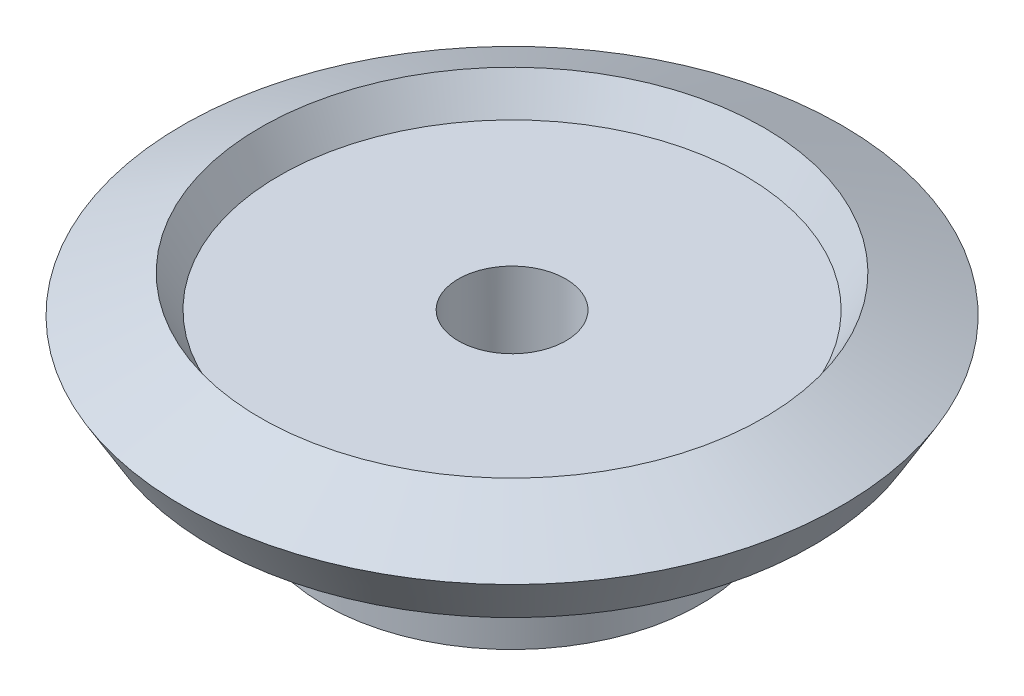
ISO-10303-21;
HEADER;
FILE_DESCRIPTION(('STEP AP214'),'2;1');
FILE_NAME('part.step','',(''),(''),'','','');
FILE_SCHEMA(('AUTOMOTIVE_DESIGN { 1 0 10303 214 1 1 1 1 }'));
ENDSEC;
DATA;
#1=APPLICATION_CONTEXT('core data for automotive mechanical design processes');
#2=APPLICATION_PROTOCOL_DEFINITION('international standard','automotive_design',2000,#1);
#3=PRODUCT_CONTEXT('',#1,'mechanical');
#4=PRODUCT('Part','Part','',(#3));
#5=PRODUCT_RELATED_PRODUCT_CATEGORY('part','',(#4));
#6=PRODUCT_DEFINITION_FORMATION('','',#4);
#7=PRODUCT_DEFINITION_CONTEXT('part definition',#1,'design');
#8=PRODUCT_DEFINITION('design','',#6,#7);
#9=PRODUCT_DEFINITION_SHAPE('','',#8);
#10=(LENGTH_UNIT() NAMED_UNIT(*) SI_UNIT(.MILLI.,.METRE.));
#11=(NAMED_UNIT(*) PLANE_ANGLE_UNIT() SI_UNIT($,.RADIAN.));
#12=(NAMED_UNIT(*) SI_UNIT($,.STERADIAN.) SOLID_ANGLE_UNIT());
#13=UNCERTAINTY_MEASURE_WITH_UNIT(LENGTH_MEASURE(1.E-05),#10,'distance_accuracy_value','');
#14=(GEOMETRIC_REPRESENTATION_CONTEXT(3) GLOBAL_UNCERTAINTY_ASSIGNED_CONTEXT((#13)) GLOBAL_UNIT_ASSIGNED_CONTEXT((#10,
#11,#12)) REPRESENTATION_CONTEXT('',''));
#15=CARTESIAN_POINT('',(0.,0.,0.));
#16=DIRECTION('',(0.,0.,1.));
#17=DIRECTION('',(1.,0.,0.));
#18=AXIS2_PLACEMENT_3D('',#15,#16,#17);
#19=CARTESIAN_POINT('',(0.,0.,0.));
#20=DIRECTION('',(0.,-1.00000000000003,0.));
#21=DIRECTION('',(0.,0.,-1.));
#22=AXIS2_PLACEMENT_3D('',#19,#20,#21);
#23=CYLINDRICAL_SURFACE('',#22,5.);
#24=CARTESIAN_POINT('',(4.91255733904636,6.00000000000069,-0.931010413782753));
#25=CARTESIAN_POINT('',(4.91255734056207,6.08992939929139,-0.931010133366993));
#26=CARTESIAN_POINT('',(4.91111901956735,6.17985768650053,-0.938698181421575));
#27=CARTESIAN_POINT('',(4.90522296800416,6.35705367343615,-0.969030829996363));
#28=CARTESIAN_POINT('',(4.9007646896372,6.44432088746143,-0.991678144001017));
#29=CARTESIAN_POINT('',(4.88844260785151,6.61359969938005,-1.05072742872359));
#30=CARTESIAN_POINT('',(4.88058536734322,6.69562107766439,-1.0871028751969));
#31=CARTESIAN_POINT('',(4.86089265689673,6.85258149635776,-1.17201330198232));
#32=CARTESIAN_POINT('',(4.84905633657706,6.92751901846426,-1.22055088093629));
#33=CARTESIAN_POINT('',(4.82025553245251,7.07105763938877,-1.32982383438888));
#34=CARTESIAN_POINT('',(4.80312692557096,7.1393474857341,-1.39092490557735));
#35=CARTESIAN_POINT('',(4.76320784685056,7.26485926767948,-1.52201845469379));
#36=CARTESIAN_POINT('',(4.74041648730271,7.32207946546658,-1.59201232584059));
#37=CARTESIAN_POINT('',(4.6879776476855,7.42523358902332,-1.74046234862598));
#38=CARTESIAN_POINT('',(4.65817007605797,7.47084230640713,-1.81908884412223));
#39=CARTESIAN_POINT('',(4.59183729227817,7.54732873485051,-1.98056425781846));
#40=CARTESIAN_POINT('',(4.55531385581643,7.57821033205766,-2.06341205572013));
#41=CARTESIAN_POINT('',(4.47725284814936,7.62331307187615,-2.22759584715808));
#42=CARTESIAN_POINT('',(4.43592913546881,7.63806721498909,-2.30888683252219));
#43=CARTESIAN_POINT('',(4.34824015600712,7.6521899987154,-2.47006387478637));
#44=CARTESIAN_POINT('',(4.30187616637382,7.65156252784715,-2.54995028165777));
#45=CARTESIAN_POINT('',(4.20741850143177,7.63528002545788,-2.70285048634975));
#46=CARTESIAN_POINT('',(4.15945987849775,7.62020373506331,-2.77601043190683));
#47=CARTESIAN_POINT('',(4.06188108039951,7.57640739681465,-2.9169284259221));
#48=CARTESIAN_POINT('',(4.01226079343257,7.54768642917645,-2.98468610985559));
#49=CARTESIAN_POINT('',(3.91257867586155,7.47707262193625,-3.11424171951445));
#50=CARTESIAN_POINT('',(3.8625194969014,7.4350133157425,-3.17595066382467));
#51=CARTESIAN_POINT('',(3.76461773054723,7.33905332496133,-3.29141183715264));
#52=CARTESIAN_POINT('',(3.71677575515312,7.28514939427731,-3.3451618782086));
#53=CARTESIAN_POINT('',(3.62323018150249,7.16410482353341,-3.44632712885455));
#54=CARTESIAN_POINT('',(3.57772749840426,7.09646769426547,-3.49333493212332));
#55=CARTESIAN_POINT('',(3.49367734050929,6.95137341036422,-3.57739583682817));
#56=CARTESIAN_POINT('',(3.45513089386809,6.87391480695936,-3.61444746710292));
#57=CARTESIAN_POINT('',(3.38673450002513,6.70996560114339,-3.67862312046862));
#58=CARTESIAN_POINT('',(3.35701119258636,6.62336561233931,-3.7056038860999));
#59=CARTESIAN_POINT('',(3.30901020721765,6.444452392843,-3.74853313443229));
#60=CARTESIAN_POINT('',(3.29072784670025,6.35214151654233,-3.76448613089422));
#61=CARTESIAN_POINT('',(3.26751373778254,6.16880983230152,-3.78465075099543));
#62=CARTESIAN_POINT('',(3.2620262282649,6.07791315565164,-3.78935139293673));
#63=CARTESIAN_POINT('',(3.26316956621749,5.89626215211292,-3.78836725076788));
#64=CARTESIAN_POINT('',(3.2697982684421,5.80550780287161,-3.78268430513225));
#65=CARTESIAN_POINT('',(3.29425527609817,5.62987992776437,-3.7613996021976));
#66=CARTESIAN_POINT('',(3.31170172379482,5.54491123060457,-3.74613582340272));
#67=CARTESIAN_POINT('',(3.3563109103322,5.37987739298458,-3.70622001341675));
#68=CARTESIAN_POINT('',(3.38347534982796,5.29981311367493,-3.68156633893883));
#69=CARTESIAN_POINT('',(3.44692776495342,5.14408997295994,-3.62224051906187));
#70=CARTESIAN_POINT('',(3.48347421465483,5.06864683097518,-3.5872794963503));
#71=CARTESIAN_POINT('',(3.56326797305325,4.92672439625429,-3.50803054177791));
#72=CARTESIAN_POINT('',(3.60651721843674,4.86024770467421,-3.4637399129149));
#73=CARTESIAN_POINT('',(3.69979967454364,4.73491681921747,-3.36397877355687));
#74=CARTESIAN_POINT('',(3.75005620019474,4.67656776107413,-3.30808063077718));
#75=CARTESIAN_POINT('',(3.85324533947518,4.57300735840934,-3.18728738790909));
#76=CARTESIAN_POINT('',(3.90617785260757,4.52779552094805,-3.1223926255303));
#77=CARTESIAN_POINT('',(4.01196744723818,4.45221100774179,-2.98522356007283));
#78=CARTESIAN_POINT('',(4.06482259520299,4.42173954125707,-2.91300242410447));
#79=CARTESIAN_POINT('',(4.16855248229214,4.37631330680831,-2.76251824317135));
#80=CARTESIAN_POINT('',(4.21942791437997,4.3613530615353,-2.68425734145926));
#81=CARTESIAN_POINT('',(4.31497479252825,4.34785918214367,-2.52765100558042));
#82=CARTESIAN_POINT('',(4.35982416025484,4.34859968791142,-2.44947597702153));
#83=CARTESIAN_POINT('',(4.44463121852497,4.36470152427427,-2.29199694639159));
#84=CARTESIAN_POINT('',(4.48458929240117,4.38006170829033,-2.21269303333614));
#85=CARTESIAN_POINT('',(4.55824674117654,4.42448830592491,-2.05662985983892));
#86=CARTESIAN_POINT('',(4.59203255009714,4.45334133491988,-1.97985022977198));
#87=CARTESIAN_POINT('',(4.65383086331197,4.5237378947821,-1.8298754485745));
#88=CARTESIAN_POINT('',(4.68184232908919,4.56528370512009,-1.75668094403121));
#89=CARTESIAN_POINT('',(4.73315022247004,4.66163265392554,-1.61347083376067));
#90=CARTESIAN_POINT('',(4.75623735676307,4.71686414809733,-1.54366861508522));
#91=CARTESIAN_POINT('',(4.79684208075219,4.83828365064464,-1.41245608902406));
#92=CARTESIAN_POINT('',(4.81435790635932,4.90447511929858,-1.35104844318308));
#93=CARTESIAN_POINT('',(4.84504742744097,5.04895585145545,-1.23659411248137));
#94=CARTESIAN_POINT('',(4.85803000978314,5.1276102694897,-1.18395569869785));
#95=CARTESIAN_POINT('',(4.87947331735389,5.29302166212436,-1.09223167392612));
#96=CARTESIAN_POINT('',(4.88793533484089,5.37977631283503,-1.05314219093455));
#97=CARTESIAN_POINT('',(4.90069084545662,5.55434327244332,-0.992047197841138));
#98=CARTESIAN_POINT('',(4.90517755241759,5.6418680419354,-0.969261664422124));
#99=CARTESIAN_POINT('',(4.91111030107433,5.81959617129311,-0.938745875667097));
#100=CARTESIAN_POINT('',(4.91255733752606,5.90979864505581,-0.93101069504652));
#101=CARTESIAN_POINT('',(4.91255733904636,6.00000000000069,-0.931010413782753));
#102=B_SPLINE_CURVE_WITH_KNOTS('',3,(#24,#25,#26,#27,#28,#29,#30,#31,#32,#33,#34,#35,#36,#37,
#38,#39,#40,#41,#42,#43,#44,#45,#46,#47,#48,#49,#50,#51,#52,#53,#54,#55,#56,#57,#58,#59,#60,#61,
#62,#63,#64,#65,#66,#67,#68,#69,#70,#71,#72,#73,#74,#75,#76,#77,#78,#79,#80,#81,#82,#83,#84,#85,
#86,#87,#88,#89,#90,#91,#92,#93,#94,#95,#96,#97,#98,#99,#100,#101),.UNSPECIFIED.,.T.,.F.,(4,2,2,
2,2,2,2,2,2,2,2,2,2,2,2,2,2,2,2,2,2,2,2,2,2,2,2,2,2,2,2,2,2,2,2,2,2,2,4),(0.,0.269454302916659,
0.538957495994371,0.807942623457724,1.07698527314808,1.35539043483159,1.63383926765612,
1.919392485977,2.20487031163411,2.48059787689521,2.75625573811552,3.0213144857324,
3.28639110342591,3.55491555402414,3.82351368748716,4.1045213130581,4.38557043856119,
4.67047751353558,4.95526790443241,5.22743703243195,5.49955797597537,5.76258081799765,
6.02564971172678,6.29693565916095,6.56830013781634,6.85241935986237,7.13652791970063,
7.41870503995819,7.70078248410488,7.96984890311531,8.23889422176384,8.50382155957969,
8.76879650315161,9.04343817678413,9.31816672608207,9.60337461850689,9.88850093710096,
10.1588585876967,10.4291277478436),.UNSPECIFIED.);
#103=CARTESIAN_POINT('',(4.91255733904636,6.00000000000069,-0.931010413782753));
#104=VERTEX_POINT('',#103);
#105=EDGE_CURVE('E115',#104,#104,#102,.T.);
#106=ORIENTED_EDGE('',*,*,#105,.F.);
#107=EDGE_LOOP('',(#106));
#108=FACE_BOUND('',#107,.T.);
#109=CARTESIAN_POINT('',(-3.26255733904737,6.00000000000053,-3.78889424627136));
#110=CARTESIAN_POINT('',(-3.26255709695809,6.08992939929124,-3.78889438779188));
#111=CARTESIAN_POINT('',(-3.26849598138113,6.17985768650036,-3.78380474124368));
#112=CARTESIAN_POINT('',(-3.29181679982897,6.35705367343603,-3.76353228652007));
#113=CARTESIAN_POINT('',(-3.30920080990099,6.44432088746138,-3.74834764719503));
#114=CARTESIAN_POINT('',(-3.35417794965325,6.61359969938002,-3.7081517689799));
#115=CARTESIAN_POINT('',(-3.38175139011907,6.6956210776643,-3.6831594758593));
#116=CARTESIAN_POINT('',(-3.44543962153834,6.85258149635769,-3.62364987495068));
#117=CARTESIAN_POINT('',(-3.48155623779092,6.92751901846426,-3.58913053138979));
#118=CARTESIAN_POINT('',(-3.56178898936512,7.07105763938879,-3.50955182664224));
#119=CARTESIAN_POINT('',(-3.60613976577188,7.13934748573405,-3.46416748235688));
#120=CARTESIAN_POINT('',(-3.69971057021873,7.26485926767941,-3.36404977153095));
#121=CARTESIAN_POINT('',(-3.74893136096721,7.32207946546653,-3.30931493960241));
#122=CARTESIAN_POINT('',(-3.85127343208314,7.42523358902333,-3.18967656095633));
#123=CARTESIAN_POINT('',(-3.90446218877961,7.47084230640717,-3.12454919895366));
#124=CARTESIAN_POINT('',(-4.01113760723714,7.54732873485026,-2.98636561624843));
#125=CARTESIAN_POINT('',(-4.06462418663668,7.57821033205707,-2.91331149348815));
#126=CARTESIAN_POINT('',(-4.16778101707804,7.62331307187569,-2.76361678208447));
#127=CARTESIAN_POINT('',(-4.2175192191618,7.63806721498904,-2.68718390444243));
#128=CARTESIAN_POINT('',(-4.31325814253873,7.65218999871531,-2.53065449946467));
#129=CARTESIAN_POINT('',(-4.3592598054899,7.65156252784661,-2.45055890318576));
#130=CARTESIAN_POINT('',(-4.44444643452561,7.63528002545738,-2.29230606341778));
#131=CARTESIAN_POINT('',(-4.48382549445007,7.62020373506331,-2.21419270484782));
#132=CARTESIAN_POINT('',(-4.55707465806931,7.57640739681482,-2.05922798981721));
#133=CARTESIAN_POINT('',(-4.59094439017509,7.54768642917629,-1.98237671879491));
#134=CARTESIAN_POINT('',(-4.65330178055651,7.47707262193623,-1.83127166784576));
#135=CARTESIAN_POINT('',(-4.68171370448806,7.43501331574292,-1.75706467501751));
#136=CARTESIAN_POINT('',(-4.73275513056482,7.33905332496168,-1.6145486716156));
#137=CARTESIAN_POINT('',(-4.7553830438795,7.28514939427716,-1.54624128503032));
#138=CARTESIAN_POINT('',(-4.79622193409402,7.16410482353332,-1.41464581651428));
#139=CARTESIAN_POINT('',(-4.81418054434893,7.09646769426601,-1.35173543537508));
#140=CARTESIAN_POINT('',(-4.84495434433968,6.95137341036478,-1.2369154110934));
#141=CARTESIAN_POINT('',(-4.85776877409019,6.87391480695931,-1.18500739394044));
#142=CARTESIAN_POINT('',(-4.87914832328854,6.70996560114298,-1.09368655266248));
#143=CARTESIAN_POINT('',(-4.88765269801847,6.62336561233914,-1.05445503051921));
#144=CARTESIAN_POINT('',(-4.9008300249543,6.444452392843,-0.991420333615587));
#145=CARTESIAN_POINT('',(-4.90550454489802,6.35214151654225,-0.967610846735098));
#146=CARTESIAN_POINT('',(-4.91136056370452,6.16880983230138,-0.937424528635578));
#147=CARTESIAN_POINT('',(-4.91268768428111,6.07791315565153,-0.930321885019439));
#148=CARTESIAN_POINT('',(-4.91240706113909,5.89626215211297,-0.931804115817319));
#149=CARTESIAN_POINT('',(-4.91079983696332,5.80550780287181,-0.9403862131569));
#150=CARTESIAN_POINT('',(-4.90459524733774,5.62987992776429,-0.972208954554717));
#151=CARTESIAN_POINT('',(-4.90009965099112,5.54491123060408,-0.994949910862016));
#152=CARTESIAN_POINT('',(-4.88783613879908,5.37987739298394,-1.05354050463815));
#153=CARTESIAN_POINT('',(-4.88006765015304,5.29981311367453,-1.08939243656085));
#154=CARTESIAN_POINT('',(-4.86041619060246,5.14408997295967,-1.17400674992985));
#155=CARTESIAN_POINT('',(-4.84841228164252,5.06864683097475,-1.22313741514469));
#156=CARTESIAN_POINT('',(-4.81967755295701,4.92672439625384,-1.33186531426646));
#157=CARTESIAN_POINT('',(-4.80294536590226,4.86024770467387,-1.39146557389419));
#158=CARTESIAN_POINT('',(-4.76319091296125,4.73491681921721,-1.52213112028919));
#159=CARTESIAN_POINT('',(-4.73990996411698,4.67656776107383,-1.59360361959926));
#160=CARTESIAN_POINT('',(-4.68689451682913,4.57300735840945,-1.74336465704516));
#161=CARTESIAN_POINT('',(-4.65716026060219,4.5277955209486,-1.82165293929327));
#162=CARTESIAN_POINT('',(-4.59126316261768,4.45221100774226,-1.981853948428));
#163=CARTESIAN_POINT('',(-4.55514539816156,4.42173954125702,-2.06373841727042));
#164=CARTESIAN_POINT('',(-4.47668721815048,4.37631330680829,-2.22881322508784));
#165=CARTESIAN_POINT('',(-4.43434900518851,4.36135306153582,-2.3120030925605));
#166=CARTESIAN_POINT('',(-4.34649737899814,4.34785918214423,-2.47305228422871));
#167=CARTESIAN_POINT('',(-4.30122050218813,4.3485996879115,-2.55098049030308));
#168=CARTESIAN_POINT('',(-4.20724319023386,4.36470152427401,-2.70316507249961));
#169=CARTESIAN_POINT('',(-4.15854302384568,4.38006170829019,-2.77742173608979));
#170=CARTESIAN_POINT('',(-4.06021707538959,4.42448830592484,-2.91924254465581));
#171=CARTESIAN_POINT('',(-4.01061686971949,4.45334133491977,-2.98689172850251));
#172=CARTESIAN_POINT('',(-3.91163405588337,4.52373789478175,-3.11539802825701));
#173=CARTESIAN_POINT('',(-3.86225148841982,4.56528370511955,-3.17625392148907));
#174=CARTESIAN_POINT('',(-3.76388184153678,4.66163265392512,-3.29229291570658));
#175=CARTESIAN_POINT('',(-3.71497491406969,4.71686414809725,-3.34718806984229));
#176=CARTESIAN_POINT('',(-3.62164389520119,4.83828365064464,-3.44795905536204));
#177=CARTESIAN_POINT('',(-3.57722122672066,4.90447511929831,-3.49383202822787));
#178=CARTESIAN_POINT('',(-3.49344562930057,5.04895585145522,-3.57763709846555));
#179=CARTESIAN_POINT('',(-3.45435071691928,5.12761026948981,-3.6151995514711));
#180=CARTESIAN_POINT('',(-3.38563703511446,5.29302166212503,-3.6796320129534));
#181=CARTESIAN_POINT('',(-3.35601555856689,5.37977631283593,-3.70650507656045));
#182=CARTESIAN_POINT('',(-3.30948349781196,5.55434327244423,-3.74809916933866));
#183=CARTESIAN_POINT('',(-3.29199400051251,5.64186804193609,-3.76337753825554));
#184=CARTESIAN_POINT('',(-3.2685329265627,5.81959617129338,-3.78377334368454));
#185=CARTESIAN_POINT('',(-3.26255758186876,5.90979864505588,-3.78889410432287));
#186=CARTESIAN_POINT('',(-3.26255733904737,6.00000000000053,-3.78889424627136));
#187=B_SPLINE_CURVE_WITH_KNOTS('',3,(#109,#110,#111,#112,#113,#114,#115,#116,#117,#118,#119,
#120,#121,#122,#123,#124,#125,#126,#127,#128,#129,#130,#131,#132,#133,#134,#135,#136,#137,#138,
#139,#140,#141,#142,#143,#144,#145,#146,#147,#148,#149,#150,#151,#152,#153,#154,#155,#156,#157,
#158,#159,#160,#161,#162,#163,#164,#165,#166,#167,#168,#169,#170,#171,#172,#173,#174,#175,#176,
#177,#178,#179,#180,#181,#182,#183,#184,#185,#186),.UNSPECIFIED.,.T.,.F.,(4,2,2,2,2,2,2,2,2,2,2,
2,2,2,2,2,2,2,2,2,2,2,2,2,2,2,2,2,2,2,2,2,2,2,2,2,2,2,4),(0.,0.269454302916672,
0.538957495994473,0.807942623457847,1.07698527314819,1.35539043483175,1.63383926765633,
1.91939248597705,2.20487031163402,2.48059787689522,2.75625573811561,3.02131448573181,
3.28639110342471,3.55491555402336,3.82351368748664,4.1045213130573,4.38557043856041,
4.67047751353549,4.9552679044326,5.22743703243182,5.49955797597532,5.76258081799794,
6.02564971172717,6.29693565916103,6.56830013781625,6.85241935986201,7.13652791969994,
7.41870503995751,7.70078248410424,7.96984890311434,8.23889422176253,8.50382155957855,
8.76879650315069,9.04343817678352,9.31816672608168,9.60337461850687,9.88850093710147,
10.1588585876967,10.4291277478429),.UNSPECIFIED.);
#188=CARTESIAN_POINT('',(-3.26255733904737,6.00000000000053,-3.78889424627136));
#189=VERTEX_POINT('',#188);
#190=EDGE_CURVE('E51',#189,#189,#187,.T.);
#191=ORIENTED_EDGE('',*,*,#190,.F.);
#192=EDGE_LOOP('',(#191));
#193=FACE_BOUND('',#192,.T.);
#194=CARTESIAN_POINT('',(-1.64999999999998,6.00000000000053,4.71990466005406));
#195=CARTESIAN_POINT('',(-1.65000024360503,6.08992939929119,4.71990452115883));
#196=CARTESIAN_POINT('',(-1.64262303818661,6.17985768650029,4.72250292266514));
#197=CARTESIAN_POINT('',(-1.61340616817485,6.35705367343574,4.73256311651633));
#198=CARTESIAN_POINT('',(-1.5915638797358,6.44432088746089,4.74002579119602));
#199=CARTESIAN_POINT('',(-1.53426465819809,6.61359969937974,4.75887919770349));
#200=CARTESIAN_POINT('',(-1.49883397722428,6.69562107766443,4.77026235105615));
#201=CARTESIAN_POINT('',(-1.41545303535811,6.85258149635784,4.79566317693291));
#202=CARTESIAN_POINT('',(-1.36750009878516,6.92751901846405,4.80968141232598));
#203=CARTESIAN_POINT('',(-1.2584665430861,7.0710576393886,4.83937566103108));
#204=CARTESIAN_POINT('',(-1.19698715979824,7.13934748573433,4.85509238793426));
#205=CARTESIAN_POINT('',(-1.0634972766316,7.26485926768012,4.88606822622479));
#206=CARTESIAN_POINT('',(-0.991485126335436,7.32207946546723,4.90132726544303));
#207=CARTESIAN_POINT('',(-0.836704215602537,7.42523358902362,4.93013890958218));
#208=CARTESIAN_POINT('',(-0.753707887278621,7.47084230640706,4.94363804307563));
#209=CARTESIAN_POINT('',(-0.580699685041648,7.54732873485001,4.96692987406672));
#210=CARTESIAN_POINT('',(-0.490689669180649,7.57821033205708,4.97672354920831));
#211=CARTESIAN_POINT('',(-0.309471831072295,7.62331307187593,4.99121262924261));
#212=CARTESIAN_POINT('',(-0.218409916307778,7.6380672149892,4.9960707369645));
#213=CARTESIAN_POINT('',(-0.0349820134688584,7.65218999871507,5.00071837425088));
#214=CARTESIAN_POINT('',(0.0573836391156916,7.65156252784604,5.00050918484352));
#215=CARTESIAN_POINT('',(0.237027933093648,7.63528002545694,4.99515654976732));
#216=CARTESIAN_POINT('',(0.324365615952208,7.62020373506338,4.99020313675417));
#217=CARTESIAN_POINT('',(0.495193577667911,7.57640739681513,4.97615641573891));
#218=CARTESIAN_POINT('',(0.578683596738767,7.54768642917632,4.96706282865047));
#219=CARTESIAN_POINT('',(0.740723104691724,7.47707262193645,4.94551338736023));
#220=CARTESIAN_POINT('',(0.819194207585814,7.43501331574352,4.9330153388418));
#221=CARTESIAN_POINT('',(0.968137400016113,7.33905332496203,4.90596050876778));
#222=CARTESIAN_POINT('',(1.03860728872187,7.28514939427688,4.89140316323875));
#223=CARTESIAN_POINT('',(1.17299175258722,7.164104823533,4.86097294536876));
#224=CARTESIAN_POINT('',(1.23645304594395,7.09646769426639,4.84507036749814));
#225=CARTESIAN_POINT('',(1.35127700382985,6.95137341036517,4.81431124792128));
#226=CARTESIAN_POINT('',(1.40263788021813,6.87391480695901,4.79945486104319));
#227=CARTESIAN_POINT('',(1.49241382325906,6.70996560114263,4.77230967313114));
#228=CARTESIAN_POINT('',(1.53064150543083,6.62336561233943,4.76005891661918));
#229=CARTESIAN_POINT('',(1.59181981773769,6.44445239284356,4.73995346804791));
#230=CARTESIAN_POINT('',(1.61477669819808,6.35214151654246,4.7320969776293));
#231=CARTESIAN_POINT('',(1.64384682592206,6.16880983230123,4.72207527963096));
#232=CARTESIAN_POINT('',(1.65066145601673,6.07791315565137,4.71967327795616));
#233=CARTESIAN_POINT('',(1.64923749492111,5.89626215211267,4.72017136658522));
#234=CARTESIAN_POINT('',(1.64100156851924,5.80550780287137,4.72307051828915));
#235=CARTESIAN_POINT('',(1.6103399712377,5.62987992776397,4.73360855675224));
#236=CARTESIAN_POINT('',(1.58839792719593,5.544911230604,4.74108573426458));
#237=CARTESIAN_POINT('',(1.53152522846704,5.37987739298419,4.75976051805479));
#238=CARTESIAN_POINT('',(1.49659230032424,5.29981311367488,4.77095877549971));
#239=CARTESIAN_POINT('',(1.41348842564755,5.14408997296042,4.79624726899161));
#240=CARTESIAN_POINT('',(1.36493806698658,5.06864683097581,4.8104169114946));
#241=CARTESIAN_POINT('',(1.25640957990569,4.92672439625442,4.839895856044));
#242=CARTESIAN_POINT('',(1.19642814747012,4.86024770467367,4.855205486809));
#243=CARTESIAN_POINT('',(1.06339123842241,4.73491681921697,4.88610989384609));
#244=CARTESIAN_POINT('',(0.989853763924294,4.6765677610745,4.90168425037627));
#245=CARTESIAN_POINT('',(0.833649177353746,4.57300735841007,4.93065204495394));
#246=CARTESIAN_POINT('',(0.750982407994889,4.52779552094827,4.94404556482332));
#247=CARTESIAN_POINT('',(0.579295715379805,4.45221100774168,4.96707750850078));
#248=CARTESIAN_POINT('',(0.490322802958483,4.42173954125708,4.97674084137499));
#249=CARTESIAN_POINT('',(0.308134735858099,4.37631330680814,4.9913314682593));
#250=CARTESIAN_POINT('',(0.214921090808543,4.3613530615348,4.99626043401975));
#251=CARTESIAN_POINT('',(0.0315225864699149,4.34785918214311,5.00070328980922));
#252=CARTESIAN_POINT('',(-0.0586036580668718,4.34859968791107,5.00045646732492));
#253=CARTESIAN_POINT('',(-0.237388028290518,4.36470152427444,4.99516201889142));
#254=CARTESIAN_POINT('',(-0.326046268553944,4.38006170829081,4.99011476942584));
#255=CARTESIAN_POINT('',(-0.49802966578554,4.42448830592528,4.97587240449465));
#256=CARTESIAN_POINT('',(-0.581415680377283,4.45334133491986,4.96674195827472));
#257=CARTESIAN_POINT('',(-0.742196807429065,4.52373789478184,4.94527347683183));
#258=CARTESIAN_POINT('',(-0.819590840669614,4.56528370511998,4.93293486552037));
#259=CARTESIAN_POINT('',(-0.96926838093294,4.66163265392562,4.90576374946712));
#260=CARTESIAN_POINT('',(-1.04126244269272,4.71686414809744,4.8908566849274));
#261=CARTESIAN_POINT('',(-1.17519818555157,4.83828365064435,4.86041514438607));
#262=CARTESIAN_POINT('',(-1.23713667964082,4.90447511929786,4.84488047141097));
#263=CARTESIAN_POINT('',(-1.35160179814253,5.04895585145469,4.81423121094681));
#264=CARTESIAN_POINT('',(-1.40367929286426,5.12761026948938,4.79915525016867));
#265=CARTESIAN_POINT('',(-1.49383628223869,5.29302166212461,4.77186368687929));
#266=CARTESIAN_POINT('',(-1.53191977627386,5.37977631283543,4.75964726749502));
#267=CARTESIAN_POINT('',(-1.59120734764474,5.55434327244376,4.74014636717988));
#268=CARTESIAN_POINT('',(-1.61318355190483,5.64186804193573,4.73263920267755));
#269=CARTESIAN_POINT('',(-1.64257737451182,5.8195961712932,4.72251921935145));
#270=CARTESIAN_POINT('',(-1.64999975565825,5.90979864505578,4.71990479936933));
#271=CARTESIAN_POINT('',(-1.64999999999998,6.00000000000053,4.71990466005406));
#272=B_SPLINE_CURVE_WITH_KNOTS('',3,(#194,#195,#196,#197,#198,#199,#200,#201,#202,#203,#204,
#205,#206,#207,#208,#209,#210,#211,#212,#213,#214,#215,#216,#217,#218,#219,#220,#221,#222,#223,
#224,#225,#226,#227,#228,#229,#230,#231,#232,#233,#234,#235,#236,#237,#238,#239,#240,#241,#242,
#243,#244,#245,#246,#247,#248,#249,#250,#251,#252,#253,#254,#255,#256,#257,#258,#259,#260,#261,
#262,#263,#264,#265,#266,#267,#268,#269,#270,#271),.UNSPECIFIED.,.T.,.F.,(4,2,2,2,2,2,2,2,2,2,2,
2,2,2,2,2,2,2,2,2,2,2,2,2,2,2,2,2,2,2,2,2,2,2,2,2,2,2,4),(0.,0.269454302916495,
0.538957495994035,0.807942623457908,1.07698527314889,1.35539043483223,1.63383926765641,
1.91939248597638,2.20487031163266,2.48059787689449,2.75625573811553,3.02131448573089,
3.28639110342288,3.55491555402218,3.82351368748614,4.10452131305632,4.38557043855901,
4.67047751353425,4.9552679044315,5.2274370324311,5.49955797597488,5.76258081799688,
6.02564971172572,6.29693565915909,6.56830013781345,6.85241935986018,7.13652791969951,
7.41870503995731,7.70078248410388,7.96984890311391,8.23889422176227,8.50382155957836,
8.76879650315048,9.04343817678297,9.31816672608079,9.60337461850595,9.88850093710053,
10.158858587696,10.4291277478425),.UNSPECIFIED.);
#273=CARTESIAN_POINT('',(-1.64999999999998,6.00000000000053,4.71990466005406));
#274=VERTEX_POINT('',#273);
#275=EDGE_CURVE('E50',#274,#274,#272,.T.);
#276=ORIENTED_EDGE('',*,*,#275,.F.);
#277=EDGE_LOOP('',(#276));
#278=FACE_BOUND('',#277,.T.);
#279=CARTESIAN_POINT('',(0.,0.,0.));
#280=DIRECTION('',(0.,-1.00000000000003,0.));
#281=DIRECTION('',(0.,0.,-1.));
#282=AXIS2_PLACEMENT_3D('',#279,#280,#281);
#283=CIRCLE('',#282,5.);
#284=CARTESIAN_POINT('',(0.,0.,-5.));
#285=VERTEX_POINT('',#284);
#286=EDGE_CURVE('E74',#285,#285,#283,.T.);
#287=ORIENTED_EDGE('',*,*,#286,.T.);
#288=EDGE_LOOP('',(#287));
#289=FACE_BOUND('',#288,.T.);
#290=CARTESIAN_POINT('',(0.,15.0000000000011,0.));
#291=DIRECTION('',(0.,-1.00000000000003,0.));
#292=DIRECTION('',(0.,0.,-1.));
#293=AXIS2_PLACEMENT_3D('',#290,#291,#292);
#294=CIRCLE('',#293,5.);
#295=CARTESIAN_POINT('',(0.,15.0000000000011,-5.00000000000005));
#296=VERTEX_POINT('',#295);
#297=EDGE_CURVE('E10',#296,#296,#294,.T.);
#298=ORIENTED_EDGE('',*,*,#297,.F.);
#299=EDGE_LOOP('',(#298));
#300=FACE_BOUND('',#299,.T.);
#301=ADVANCED_FACE('F24',(#108,#193,#278,#289,#300),#23,.F.);
#302=CARTESIAN_POINT('',(21.6580899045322,15.0000000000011,-2.97882925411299E-13));
#303=DIRECTION('',(0.,1.00000000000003,0.));
#304=DIRECTION('',(0.,0.,1.));
#305=AXIS2_PLACEMENT_3D('',#302,#303,#304);
#306=PLANE('',#305);
#307=ORIENTED_EDGE('',*,*,#297,.T.);
#308=EDGE_LOOP('',(#307));
#309=FACE_BOUND('',#308,.T.);
#310=CARTESIAN_POINT('',(0.,15.0000000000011,0.));
#311=DIRECTION('',(0.,-1.00000000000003,0.));
#312=DIRECTION('',(0.,0.,-1.));
#313=AXIS2_PLACEMENT_3D('',#310,#311,#312);
#314=CIRCLE('',#313,21.6580899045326);
#315=CARTESIAN_POINT('',(2.49796390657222E-13,15.0000000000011,-21.6580899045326));
#316=VERTEX_POINT('',#315);
#317=EDGE_CURVE('E36',#316,#316,#314,.T.);
#318=ORIENTED_EDGE('',*,*,#317,.F.);
#319=EDGE_LOOP('',(#318));
#320=FACE_BOUND('',#319,.T.);
#321=ADVANCED_FACE('F99',(#309,#320),#306,.T.);
#322=CARTESIAN_POINT('',(0.,18.0000000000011,0.));
#323=DIRECTION('',(0.,1.00000000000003,0.));
#324=DIRECTION('',(0.,0.,1.));
#325=AXIS2_PLACEMENT_3D('',#322,#323,#324);
#326=CONICAL_SURFACE('',#325,23.4176206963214,0.53044152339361);
#327=ORIENTED_EDGE('',*,*,#317,.T.);
#328=EDGE_LOOP('',(#327));
#329=FACE_BOUND('',#328,.T.);
#330=CARTESIAN_POINT('',(0.,18.0000000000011,0.));
#331=DIRECTION('',(0.,-1.00000000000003,0.));
#332=DIRECTION('',(0.,0.,-1.));
#333=AXIS2_PLACEMENT_3D('',#330,#331,#332);
#334=CIRCLE('',#333,23.4176206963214);
#335=CARTESIAN_POINT('',(2.70090167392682E-13,18.0000000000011,-23.4176206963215));
#336=VERTEX_POINT('',#335);
#337=EDGE_CURVE('E41',#336,#336,#334,.T.);
#338=ORIENTED_EDGE('',*,*,#337,.F.);
#339=EDGE_LOOP('',(#338));
#340=FACE_BOUND('',#339,.T.);
#341=ADVANCED_FACE('F97',(#329,#340),#326,.F.);
#342=CARTESIAN_POINT('',(0.,14.5523500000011,0.));
#343=DIRECTION('',(0.,-1.00000000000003,0.));
#344=DIRECTION('',(0.,0.,-1.));
#345=AXIS2_PLACEMENT_3D('',#342,#343,#344);
#346=CONICAL_SURFACE('',#345,30.67,1.12703642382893);
#347=ORIENTED_EDGE('',*,*,#337,.T.);
#348=EDGE_LOOP('',(#347));
#349=FACE_BOUND('',#348,.T.);
#350=CARTESIAN_POINT('',(0.,14.5523500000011,0.));
#351=DIRECTION('',(0.,-1.00000000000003,0.));
#352=DIRECTION('',(0.,0.,-1.));
#353=AXIS2_PLACEMENT_3D('',#350,#351,#352);
#354=CIRCLE('',#353,30.67);
#355=CARTESIAN_POINT('',(2.70469698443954E-13,14.5523500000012,-30.67));
#356=VERTEX_POINT('',#355);
#357=EDGE_CURVE('E89',#356,#356,#354,.T.);
#358=ORIENTED_EDGE('',*,*,#357,.F.);
#359=EDGE_LOOP('',(#358));
#360=FACE_BOUND('',#359,.T.);
#361=ADVANCED_FACE('F94',(#349,#360),#346,.T.);
#362=CARTESIAN_POINT('',(0.,10.0000000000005,0.));
#363=DIRECTION('',(0.,1.00000000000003,0.));
#364=DIRECTION('',(0.,0.,1.));
#365=AXIS2_PLACEMENT_3D('',#362,#363,#364);
#366=CONICAL_SURFACE('',#365,28.,0.530441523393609);
#367=ORIENTED_EDGE('',*,*,#357,.T.);
#368=EDGE_LOOP('',(#367));
#369=FACE_BOUND('',#368,.T.);
#370=CARTESIAN_POINT('',(0.,10.0000000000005,0.));
#371=DIRECTION('',(0.,-1.00000000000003,0.));
#372=DIRECTION('',(0.,0.,-1.));
#373=AXIS2_PLACEMENT_3D('',#370,#371,#372);
#374=CIRCLE('',#373,28.);
#375=CARTESIAN_POINT('',(3.22941633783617E-13,10.0000000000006,-28.));
#376=VERTEX_POINT('',#375);
#377=EDGE_CURVE('E86',#376,#376,#374,.T.);
#378=ORIENTED_EDGE('',*,*,#377,.F.);
#379=EDGE_LOOP('',(#378));
#380=FACE_BOUND('',#379,.T.);
#381=ADVANCED_FACE('F106',(#369,#380),#366,.T.);
#382=CARTESIAN_POINT('',(28.,10.0000000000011,-3.54999323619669E-13));
#383=DIRECTION('',(0.,-1.00000000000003,0.));
#384=DIRECTION('',(0.,0.,-1.));
#385=AXIS2_PLACEMENT_3D('',#382,#383,#384);
#386=PLANE('',#385);
#387=ORIENTED_EDGE('',*,*,#377,.T.);
#388=EDGE_LOOP('',(#387));
#389=FACE_BOUND('',#388,.T.);
#390=CARTESIAN_POINT('',(0.,10.0000000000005,0.));
#391=DIRECTION('',(0.,-1.00000000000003,0.));
#392=DIRECTION('',(0.,0.,-1.));
#393=AXIS2_PLACEMENT_3D('',#390,#391,#392);
#394=CIRCLE('',#393,17.5);
#395=CARTESIAN_POINT('',(2.01838521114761E-13,10.0000000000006,-17.5));
#396=VERTEX_POINT('',#395);
#397=EDGE_CURVE('E83',#396,#396,#394,.T.);
#398=ORIENTED_EDGE('',*,*,#397,.F.);
#399=EDGE_LOOP('',(#398));
#400=FACE_BOUND('',#399,.T.);
#401=ADVANCED_FACE('F129',(#389,#400),#386,.T.);
#402=CARTESIAN_POINT('',(0.,0.,0.));
#403=DIRECTION('',(0.,-1.00000000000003,0.));
#404=DIRECTION('',(0.,0.,-1.));
#405=AXIS2_PLACEMENT_3D('',#402,#403,#404);
#406=CYLINDRICAL_SURFACE('',#405,17.5);
#407=CARTESIAN_POINT('',(15.9129297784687,6.00000000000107,-7.28207840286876));
#408=CARTESIAN_POINT('',(15.9129286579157,5.90754004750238,-7.28208239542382));
#409=CARTESIAN_POINT('',(15.909675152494,5.81501830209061,-7.28920351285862));
#410=CARTESIAN_POINT('',(15.8966918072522,5.63253810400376,-7.31747375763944));
#411=CARTESIAN_POINT('',(15.886954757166,5.54258262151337,-7.3386385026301));
#412=CARTESIAN_POINT('',(15.8611315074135,5.36790408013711,-7.39428444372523));
#413=CARTESIAN_POINT('',(15.8450490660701,5.28317795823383,-7.42875775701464));
#414=CARTESIAN_POINT('',(15.8067574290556,5.12130804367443,-7.50988828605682));
#415=CARTESIAN_POINT('',(15.7845494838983,5.04416270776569,-7.55654301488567));
#416=CARTESIAN_POINT('',(15.7342612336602,4.89937469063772,-7.66070282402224));
#417=CARTESIAN_POINT('',(15.7061641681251,4.83176007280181,-7.71823882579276));
#418=CARTESIAN_POINT('',(15.6446014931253,4.70819428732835,-7.8422718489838));
#419=CARTESIAN_POINT('',(15.6111356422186,4.6522436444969,-7.9087692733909));
#420=CARTESIAN_POINT('',(15.5393966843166,4.55349818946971,-8.04880998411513));
#421=CARTESIAN_POINT('',(15.5011147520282,4.51072803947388,-8.12236614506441));
#422=CARTESIAN_POINT('',(15.4206109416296,4.4397154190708,-8.27418471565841));
#423=CARTESIAN_POINT('',(15.3783891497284,4.41147263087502,-8.35244702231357));
#424=CARTESIAN_POINT('',(15.2911522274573,4.37039827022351,-8.51110040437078));
#425=CARTESIAN_POINT('',(15.2461458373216,4.35752081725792,-8.59148440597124));
#426=CARTESIAN_POINT('',(15.1544224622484,4.34740075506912,-8.75225933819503));
#427=CARTESIAN_POINT('',(15.107705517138,4.35015778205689,-8.83265026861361));
#428=CARTESIAN_POINT('',(15.014064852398,4.37119107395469,-8.99090015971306));
#429=CARTESIAN_POINT('',(14.9671422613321,4.38941800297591,-9.06876635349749));
#430=CARTESIAN_POINT('',(14.8743935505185,4.44079689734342,-9.22010294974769));
#431=CARTESIAN_POINT('',(14.8285674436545,4.47394903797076,-9.29357330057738));
#432=CARTESIAN_POINT('',(14.7394425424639,4.55429170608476,-9.43428790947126));
#433=CARTESIAN_POINT('',(14.6961478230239,4.60150416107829,-9.50152222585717));
#434=CARTESIAN_POINT('',(14.6136544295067,4.70861134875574,-9.62791822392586));
#435=CARTESIAN_POINT('',(14.5744558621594,4.7685064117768,-9.68707969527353));
#436=CARTESIAN_POINT('',(14.5014229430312,4.8995562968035,-9.79607384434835));
#437=CARTESIAN_POINT('',(14.4676100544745,4.97075401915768,-9.84586933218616));
#438=CARTESIAN_POINT('',(14.4068093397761,5.1222391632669,-9.93462370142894));
#439=CARTESIAN_POINT('',(14.3798215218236,5.20252659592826,-9.97358256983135));
#440=CARTESIAN_POINT('',(14.3337229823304,5.36994405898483,-10.0397220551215));
#441=CARTESIAN_POINT('',(14.3146136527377,5.45707529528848,-10.0669005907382));
#442=CARTESIAN_POINT('',(14.2850515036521,5.63569142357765,-10.1088064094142));
#443=CARTESIAN_POINT('',(14.2745984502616,5.72717619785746,-10.1235340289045));
#444=CARTESIAN_POINT('',(14.2628021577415,5.91152597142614,-10.1401469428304));
#445=CARTESIAN_POINT('',(14.2614240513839,6.00438431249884,-10.1420813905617));
#446=CARTESIAN_POINT('',(14.2677418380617,6.1891759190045,-10.1331915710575));
#447=CARTESIAN_POINT('',(14.2754376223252,6.2811091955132,-10.1223674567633));
#448=CARTESIAN_POINT('',(14.299563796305,6.46126708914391,-10.0882558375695));
#449=CARTESIAN_POINT('',(14.3159779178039,6.54949828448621,-10.0649915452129));
#450=CARTESIAN_POINT('',(14.3568701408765,6.71995167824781,-10.0065750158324));
#451=CARTESIAN_POINT('',(14.3813484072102,6.80217375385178,-9.97142253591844));
#452=CARTESIAN_POINT('',(14.4374968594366,6.95854880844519,-9.88995096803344));
#453=CARTESIAN_POINT('',(14.4691886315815,7.03267655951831,-9.8435983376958));
#454=CARTESIAN_POINT('',(14.5385186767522,7.17050323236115,-9.7409087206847));
#455=CARTESIAN_POINT('',(14.5761570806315,7.23420192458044,-9.68457151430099));
#456=CARTESIAN_POINT('',(14.6561333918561,7.34956845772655,-9.56310870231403));
#457=CARTESIAN_POINT('',(14.6984859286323,7.40119721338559,-9.4979555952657));
#458=CARTESIAN_POINT('',(14.7862981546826,7.49068964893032,-9.36066332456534));
#459=CARTESIAN_POINT('',(14.8317578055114,7.52855349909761,-9.28852424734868));
#460=CARTESIAN_POINT('',(14.9241798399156,7.58937475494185,-9.13928557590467));
#461=CARTESIAN_POINT('',(14.9711396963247,7.61235597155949,-9.06219412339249));
#462=CARTESIAN_POINT('',(15.0651373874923,7.64283735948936,-8.90505549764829));
#463=CARTESIAN_POINT('',(15.1121752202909,7.6503379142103,-8.82500839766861));
#464=CARTESIAN_POINT('',(15.2047494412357,7.64964001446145,-8.66453359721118));
#465=CARTESIAN_POINT('',(15.2502909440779,7.64150232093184,-8.58410857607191));
#466=CARTESIAN_POINT('',(15.3388251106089,7.60988608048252,-8.42488842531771));
#467=CARTESIAN_POINT('',(15.3818177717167,7.58640751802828,-8.34609329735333));
#468=CARTESIAN_POINT('',(15.4641913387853,7.52479235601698,-8.19245929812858));
#469=CARTESIAN_POINT('',(15.5035726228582,7.48665729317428,-8.11762001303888));
#470=CARTESIAN_POINT('',(15.5778642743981,7.39681825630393,-7.97412570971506));
#471=CARTESIAN_POINT('',(15.6127746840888,7.34511441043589,-7.90547063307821));
#472=CARTESIAN_POINT('',(15.6775696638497,7.22937739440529,-7.77618587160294));
#473=CARTESIAN_POINT('',(15.7074350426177,7.16529904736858,-7.71558701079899));
#474=CARTESIAN_POINT('',(15.7614727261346,7.02671897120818,-7.60459065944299));
#475=CARTESIAN_POINT('',(15.7856436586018,6.95221473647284,-7.55419562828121));
#476=CARTESIAN_POINT('',(15.8279597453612,6.79471359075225,-7.46512792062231));
#477=CARTESIAN_POINT('',(15.8460909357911,6.71169757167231,-7.42648242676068));
#478=CARTESIAN_POINT('',(15.8759809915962,6.53972212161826,-7.36236988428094));
#479=CARTESIAN_POINT('',(15.8877470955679,6.45076957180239,-7.33688786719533));
#480=CARTESIAN_POINT('',(15.9018094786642,6.30108794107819,-7.30634110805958));
#481=CARTESIAN_POINT('',(15.9059766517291,6.24131796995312,-7.29725646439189));
#482=CARTESIAN_POINT('',(15.9115371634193,6.12104082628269,-7.28512381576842));
#483=CARTESIAN_POINT('',(15.9129305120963,6.06053365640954,-7.28207578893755));
#484=CARTESIAN_POINT('',(15.9129297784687,6.00000000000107,-7.28207840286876));
#485=B_SPLINE_CURVE_WITH_KNOTS('',3,(#407,#408,#409,#410,#411,#412,#413,#414,#415,#416,#417,
#418,#419,#420,#421,#422,#423,#424,#425,#426,#427,#428,#429,#430,#431,#432,#433,#434,#435,#436,
#437,#438,#439,#440,#441,#442,#443,#444,#445,#446,#447,#448,#449,#450,#451,#452,#453,#454,#455,
#456,#457,#458,#459,#460,#461,#462,#463,#464,#465,#466,#467,#468,#469,#470,#471,#472,#473,#474,
#475,#476,#477,#478,#479,#480,#481,#482,#483,#484),.UNSPECIFIED.,.T.,.F.,(4,2,2,2,2,2,2,2,2,2,2,
2,2,2,2,2,2,2,2,2,2,2,2,2,2,2,2,2,2,2,2,2,2,2,2,2,2,2,4),(0.,0.277158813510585,
0.554626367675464,0.831929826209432,1.10917671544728,1.38722363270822,1.66528305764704,
1.94385964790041,2.22243014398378,2.50016673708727,2.77789686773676,3.05474458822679,
3.33159556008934,3.60888057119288,3.88617280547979,4.16454386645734,4.44291526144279,
4.72133581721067,4.99974884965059,5.27709155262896,5.55443093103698,5.83125460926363,
6.10808394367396,6.38575283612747,6.66342783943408,6.94198993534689,7.2205485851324,
7.49866045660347,7.77676544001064,8.0537920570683,8.33081895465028,8.607816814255,
8.88481205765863,9.16283835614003,9.44093158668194,9.7196633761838,9.99807751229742,
10.1795344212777,10.3609906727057),.UNSPECIFIED.);
#486=CARTESIAN_POINT('',(15.9129297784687,6.00000000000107,-7.28207840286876));
#487=VERTEX_POINT('',#486);
#488=EDGE_CURVE('E28',#487,#487,#485,.T.);
#489=ORIENTED_EDGE('',*,*,#488,.F.);
#490=EDGE_LOOP('',(#489));
#491=FACE_BOUND('',#490,.T.);
#492=CARTESIAN_POINT('',(-14.2629297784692,6.00000000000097,-10.1399622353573));
#493=CARTESIAN_POINT('',(-14.2629326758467,5.90754004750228,-10.1399592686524));
#494=CARTESIAN_POINT('',(-14.2674729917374,5.81501830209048,-10.1335810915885));
#495=CARTESIAN_POINT('',(-14.2854640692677,5.63253810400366,-10.1082020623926));
#496=CARTESIAN_POINT('',(-14.2989247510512,5.54258262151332,-10.0891871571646));
#497=CARTESIAN_POINT('',(-14.3342039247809,5.36790408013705,-10.0390005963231));
#498=CARTESIAN_POINT('',(-14.3560174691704,5.28317795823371,-10.0078361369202));
#499=CARTESIAN_POINT('',(-14.4071327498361,5.12130804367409,-9.93410934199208));
#500=CARTESIAN_POINT('',(-14.4364329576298,5.04416270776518,-9.89154933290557));
#501=CARTESIAN_POINT('',(-14.5014938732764,4.89937469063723,-9.79591852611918));
#502=CARTESIAN_POINT('',(-14.5372729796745,4.83176007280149,-9.74281775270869));
#503=CARTESIAN_POINT('',(-14.6139073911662,4.70819428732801,-9.62748640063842));
#504=CARTESIAN_POINT('',(-14.6547629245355,4.65224364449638,-9.56525541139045));
#505=CARTESIAN_POINT('',(-14.7401722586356,4.55349818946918,-9.43310729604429));
#506=CARTESIAN_POINT('',(-14.7847327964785,4.51072803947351,-9.36317608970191));
#507=CARTESIAN_POINT('',(-14.8759596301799,4.43971541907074,-9.2175484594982));
#508=CARTESIAN_POINT('',(-14.9226258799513,4.41147263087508,-9.14185216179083));
#509=CARTESIAN_POINT('',(-15.0164052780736,4.37039827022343,-8.98697607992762));
#510=CARTESIAN_POINT('',(-15.0635166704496,4.35752081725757,-8.90780740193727));
#511=CARTESIAN_POINT('',(-15.1568901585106,4.34740075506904,-8.74798516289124));
#512=CARTESIAN_POINT('',(-15.2031522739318,4.35015778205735,-8.66733163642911));
#513=CARTESIAN_POINT('',(-15.2933803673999,4.37119107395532,-8.50711149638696));
#514=CARTESIAN_POINT('',(-15.3373531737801,4.38941800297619,-8.42754224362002));
#515=CARTESIAN_POINT('',(-15.4220401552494,4.44079689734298,-8.27155120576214));
#516=CARTESIAN_POINT('',(-15.4627542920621,4.47394903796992,-8.19512945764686));
#517=CARTESIAN_POINT('',(-15.5400542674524,4.55429170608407,-8.04758772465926));
#518=CARTESIAN_POINT('',(-15.5766335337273,4.60150416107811,-7.97647623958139));
#519=CARTESIAN_POINT('',(-15.6448489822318,4.70861134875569,-7.84183686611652));
#520=CARTESIAN_POINT('',(-15.6764850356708,4.76850641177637,-7.77830917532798));
#521=CARTESIAN_POINT('',(-15.7343602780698,4.89955629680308,-7.66056373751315));
#522=CARTESIAN_POINT('',(-15.7605779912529,4.97075401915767,-7.60638317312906));
#523=CARTESIAN_POINT('',(-15.8070411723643,5.12223916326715,-7.5093510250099));
#524=CARTESIAN_POINT('',(-15.8272866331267,5.20252659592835,-7.46649945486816));
#525=CARTESIAN_POINT('',(-15.8615158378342,5.36994405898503,-7.39350720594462));
#526=CARTESIAN_POINT('',(-15.87549847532,5.45707529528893,-7.36336877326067));
#527=CARTESIAN_POINT('',(-15.8970089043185,5.6356914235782,-7.31681429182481));
#528=CARTESIAN_POINT('',(-15.9045368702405,5.72717619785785,-7.30039787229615));
#529=CARTESIAN_POINT('',(-15.9130259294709,5.91152597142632,-7.28187552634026));
#530=CARTESIAN_POINT('',(-15.9140121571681,6.00438431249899,-7.27971482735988));
#531=CARTESIAN_POINT('',(-15.9094722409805,6.18917591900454,-7.2896311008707));
#532=CARTESIAN_POINT('',(-15.903946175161,6.28110919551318,-7.30170790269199));
#533=CARTESIAN_POINT('',(-15.886467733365,6.46126708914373,-7.33965759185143));
#534=CARTESIAN_POINT('',(-15.874527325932,6.54949828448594,-7.3655047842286));
#535=CARTESIAN_POINT('',(-15.8443832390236,6.71995167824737,-7.43012675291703));
#536=CARTESIAN_POINT('',(-15.8261794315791,6.80217375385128,-7.4689017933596));
#537=CARTESIAN_POINT('',(-15.7836972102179,6.95854880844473,-7.55826356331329));
#538=CARTESIAN_POINT('',(-15.7594005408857,7.03267655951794,-7.60888575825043));
#539=CARTESIAN_POINT('',(-15.7051337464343,7.17050323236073,-7.72027214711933));
#540=CARTESIAN_POINT('',(-15.6751634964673,7.23420192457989,-7.78103656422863));
#541=CARTESIAN_POINT('',(-15.6099617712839,7.34956845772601,-7.91102948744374));
#542=CARTESIAN_POINT('',(-15.5747137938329,7.40119721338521,-7.98028441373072));
#543=CARTESIAN_POINT('',(-15.4997213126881,7.49068964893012,-8.12497816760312));
#544=CARTESIAN_POINT('',(-15.4599768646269,7.52855349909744,-8.20041691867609));
#545=CARTESIAN_POINT('',(-15.3769434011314,7.58937475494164,-8.35507608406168));
#546=CARTESIAN_POINT('',(-15.3336601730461,7.6123559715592,-8.43429023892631));
#547=CARTESIAN_POINT('',(-15.2445729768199,7.64283735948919,-8.59426394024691));
#548=CARTESIAN_POINT('',(-15.1987690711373,7.65033791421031,-8.67502344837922));
#549=CARTESIAN_POINT('',(-15.1060809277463,7.64964001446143,-8.83543247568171));
#550=CARTESIAN_POINT('',(-15.059201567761,7.64150232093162,-8.91508508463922));
#551=CARTESIAN_POINT('',(-14.965579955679,7.60988608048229,-9.07136799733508));
#552=CARTESIAN_POINT('',(-14.9188377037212,7.58640751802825,-9.14799829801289));
#553=CARTESIAN_POINT('',(-14.8269735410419,7.524792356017,-9.29615289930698));
#554=CARTESIAN_POINT('',(-14.7818514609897,7.48665729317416,-9.36767773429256));
#555=CARTESIAN_POINT('',(-14.6947275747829,7.39681825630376,-9.50376334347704));
#556=CARTESIAN_POINT('',(-14.6527257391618,7.34511441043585,-9.56832418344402));
#557=CARTESIAN_POINT('',(-14.5731593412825,7.22937739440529,-9.68908066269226));
#558=CARTESIAN_POINT('',(-14.53561187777,7.16529904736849,-9.74524426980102));
#559=CARTESIAN_POINT('',(-14.4665050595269,7.02671897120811,-9.84754045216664));
#560=CARTESIAN_POINT('',(-14.4349471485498,6.95221473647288,-9.89367060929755));
#561=CARTESIAN_POINT('',(-14.3789702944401,6.79471359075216,-9.97485126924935));
#562=CARTESIAN_POINT('',(-14.3545679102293,6.71169757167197,-10.009876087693));
#563=CARTESIAN_POINT('',(-14.3139898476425,6.53972212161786,-10.0678179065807));
#564=CARTESIAN_POINT('',(-14.2978048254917,6.45076957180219,-10.090748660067));
#565=CARTESIAN_POINT('',(-14.2783817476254,6.301087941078,-10.1182004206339));
#566=CARTESIAN_POINT('',(-14.2725978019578,6.24131796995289,-10.1263516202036));
#567=CARTESIAN_POINT('',(-14.2648708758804,6.12104082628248,-10.1372334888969));
#568=CARTESIAN_POINT('',(-14.2629278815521,6.06053365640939,-10.139964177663));
#569=CARTESIAN_POINT('',(-14.2629297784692,6.00000000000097,-10.1399622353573));
#570=B_SPLINE_CURVE_WITH_KNOTS('',3,(#492,#493,#494,#495,#496,#497,#498,#499,#500,#501,#502,
#503,#504,#505,#506,#507,#508,#509,#510,#511,#512,#513,#514,#515,#516,#517,#518,#519,#520,#521,
#522,#523,#524,#525,#526,#527,#528,#529,#530,#531,#532,#533,#534,#535,#536,#537,#538,#539,#540,
#541,#542,#543,#544,#545,#546,#547,#548,#549,#550,#551,#552,#553,#554,#555,#556,#557,#558,#559,
#560,#561,#562,#563,#564,#565,#566,#567,#568,#569),.UNSPECIFIED.,.T.,.F.,(4,2,2,2,2,2,2,2,2,2,2,
2,2,2,2,2,2,2,2,2,2,2,2,2,2,2,2,2,2,2,2,2,2,2,2,2,2,2,4),(0.,0.277158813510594,
0.554626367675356,0.831929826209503,1.10917671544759,1.38722363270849,1.66528305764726,
1.94385964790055,2.22243014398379,2.50016673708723,2.77789686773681,3.05474458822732,
3.33159556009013,3.60888057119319,3.88617280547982,4.16454386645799,4.44291526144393,
4.72133581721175,4.99974884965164,5.27709155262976,5.55443093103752,5.83125460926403,
6.10808394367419,6.38575283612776,6.66342783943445,6.94198993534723,7.22054858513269,
7.4986604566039,7.77676544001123,8.05379205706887,8.33081895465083,8.60781681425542,
8.8848120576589,9.16283835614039,9.44093158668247,9.7196633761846,9.99807751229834,
10.1795344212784,10.3609906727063),.UNSPECIFIED.);
#571=CARTESIAN_POINT('',(-14.2629297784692,6.00000000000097,-10.1399622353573));
#572=VERTEX_POINT('',#571);
#573=EDGE_CURVE('E52',#572,#572,#570,.T.);
#574=ORIENTED_EDGE('',*,*,#573,.F.);
#575=EDGE_LOOP('',(#574));
#576=FACE_BOUND('',#575,.T.);
#577=CARTESIAN_POINT('',(-1.64999999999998,6.00000000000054,17.4220406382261));
#578=CARTESIAN_POINT('',(-1.64999598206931,5.90754004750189,17.4220416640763));
#579=CARTESIAN_POINT('',(-1.6422021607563,5.81501830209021,17.4227846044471));
#580=CARTESIAN_POINT('',(-1.61122773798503,5.6325381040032,17.425675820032));
#581=CARTESIAN_POINT('',(-1.58803000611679,5.54258262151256,17.4278256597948));
#582=CARTESIAN_POINT('',(-1.52692758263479,5.36790408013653,17.4332850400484));
#583=CARTESIAN_POINT('',(-1.48903159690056,5.28317795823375,17.4365938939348));
#584=CARTESIAN_POINT('',(-1.39962467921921,5.12130804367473,17.4439976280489));
#585=CARTESIAN_POINT('',(-1.34811652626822,5.04416270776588,17.4480923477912));
#586=CARTESIAN_POINT('',(-1.23276736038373,4.89937469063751,17.4566213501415));
#587=CARTESIAN_POINT('',(-1.16889118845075,4.83176007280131,17.4610565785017));
#588=CARTESIAN_POINT('',(-1.03069410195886,4.70819428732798,17.4697582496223));
#589=CARTESIAN_POINT('',(-0.956372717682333,4.65224364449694,17.4740246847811));
#590=CARTESIAN_POINT('',(-0.799224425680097,4.55349818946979,17.4819172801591));
#591=CARTESIAN_POINT('',(-0.716381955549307,4.51072803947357,17.4855422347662));
#592=CARTESIAN_POINT('',(-0.544651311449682,4.43971541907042,17.4917331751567));
#593=CARTESIAN_POINT('',(-0.455763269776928,4.41147263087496,17.4942991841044));
#594=CARTESIAN_POINT('',(-0.274746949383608,4.37039827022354,17.4980764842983));
#595=CARTESIAN_POINT('',(-0.182629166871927,4.35752081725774,17.4992918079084));
#596=CARTESIAN_POINT('',(0.00246769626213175,4.3474007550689,17.5002445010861));
#597=CARTESIAN_POINT('',(0.0954467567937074,4.35015778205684,17.4999819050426));
#598=CARTESIAN_POINT('',(0.279315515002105,4.37119107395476,17.4980116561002));
#599=CARTESIAN_POINT('',(0.37021091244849,4.38941800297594,17.496308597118));
#600=CARTESIAN_POINT('',(0.547646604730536,4.4407968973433,17.4916541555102));
#601=CARTESIAN_POINT('',(0.63418684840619,4.47394903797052,17.4887027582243));
#602=CARTESIAN_POINT('',(0.800611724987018,4.55429170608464,17.4818756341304));
#603=CARTESIAN_POINT('',(0.880485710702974,4.60150416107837,17.4779984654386));
#604=CARTESIAN_POINT('',(1.03119455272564,4.70861134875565,17.4697550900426));
#605=CARTESIAN_POINT('',(1.10202917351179,4.76850641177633,17.4653888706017));
#606=CARTESIAN_POINT('',(1.23293733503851,4.89955629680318,17.4566375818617));
#607=CARTESIAN_POINT('',(1.29296793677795,4.97075401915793,17.4522525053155));
#608=CARTESIAN_POINT('',(1.40023183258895,5.12223916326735,17.443974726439));
#609=CARTESIAN_POINT('',(1.44746511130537,5.20252659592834,17.4400820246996));
#610=CARTESIAN_POINT('',(1.52779285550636,5.36994405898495,17.4332292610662));
#611=CARTESIAN_POINT('',(1.56088482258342,5.457075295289,17.4302693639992));
#612=CARTESIAN_POINT('',(1.6119574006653,5.63569142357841,17.4256207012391));
#613=CARTESIAN_POINT('',(1.62993841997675,5.72717619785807,17.4239319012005));
#614=CARTESIAN_POINT('',(1.65022377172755,5.91152597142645,17.4220224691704));
#615=CARTESIAN_POINT('',(1.65258810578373,6.00438431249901,17.4217962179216));
#616=CARTESIAN_POINT('',(1.64173040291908,6.18917591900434,17.4228226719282));
#617=CARTESIAN_POINT('',(1.6285085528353,6.28110919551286,17.4240753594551));
#618=CARTESIAN_POINT('',(1.58690393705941,6.46126708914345,17.4279134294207));
#619=CARTESIAN_POINT('',(1.5585494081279,6.5494982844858,17.4304963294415));
#620=CARTESIAN_POINT('',(1.48751309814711,6.71995167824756,17.4367017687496));
#621=CARTESIAN_POINT('',(1.44483102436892,6.80217375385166,17.4403243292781));
#622=CARTESIAN_POINT('',(1.34620035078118,6.95854880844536,17.4482145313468));
#623=CARTESIAN_POINT('',(1.29021190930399,7.03267655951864,17.4524840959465));
#624=CARTESIAN_POINT('',(1.16661506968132,7.17050323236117,17.4611808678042));
#625=CARTESIAN_POINT('',(1.09900641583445,7.23420192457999,17.4656080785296));
#626=CARTESIAN_POINT('',(0.953828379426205,7.34956845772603,17.4741381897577));
#627=CARTESIAN_POINT('',(0.876227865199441,7.40119721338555,17.4782400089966));
#628=CARTESIAN_POINT('',(0.713423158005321,7.49068964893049,17.4856414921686));
#629=CARTESIAN_POINT('',(0.628219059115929,7.52855349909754,17.4889411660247));
#630=CARTESIAN_POINT('',(0.452763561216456,7.58937475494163,17.4943616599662));
#631=CARTESIAN_POINT('',(0.362520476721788,7.61235597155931,17.4964843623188));
#632=CARTESIAN_POINT('',(0.179435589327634,7.64283735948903,17.4993194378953));
#633=CARTESIAN_POINT('',(0.0865938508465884,7.65033791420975,17.5000318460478));
#634=CARTESIAN_POINT('',(-0.0986685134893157,7.64964001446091,17.4999660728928));
#635=CARTESIAN_POINT('',(-0.191089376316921,7.64150232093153,17.4991936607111));
#636=CARTESIAN_POINT('',(-0.373245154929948,7.60988608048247,17.4962564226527));
#637=CARTESIAN_POINT('',(-0.462980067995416,7.58640751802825,17.4940915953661));
#638=CARTESIAN_POINT('',(-0.637217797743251,7.52479235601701,17.4886121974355));
#639=CARTESIAN_POINT('',(-0.721721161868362,7.48665729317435,17.4852977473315));
#640=CARTESIAN_POINT('',(-0.883136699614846,7.39681825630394,17.4778890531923));
#641=CARTESIAN_POINT('',(-0.960048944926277,7.3451144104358,17.4737948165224));
#642=CARTESIAN_POINT('',(-1.10441032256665,7.22937739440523,17.4652665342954));
#643=CARTESIAN_POINT('',(-1.17182316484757,7.16529904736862,17.4608312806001));
#644=CARTESIAN_POINT('',(-1.29496766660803,7.02671897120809,17.4521311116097));
#645=CARTESIAN_POINT('',(-1.35069651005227,6.95221473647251,17.4478662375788));
#646=CARTESIAN_POINT('',(-1.44898945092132,6.7947135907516,17.4399791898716));
#647=CARTESIAN_POINT('',(-1.49152302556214,6.71169757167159,17.4363585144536));
#648=CARTESIAN_POINT('',(-1.56199114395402,6.53972212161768,17.4301877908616));
#649=CARTESIAN_POINT('',(-1.5899422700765,6.45076957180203,17.4276365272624));
#650=CARTESIAN_POINT('',(-1.62342773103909,6.30108794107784,17.4245415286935));
#651=CARTESIAN_POINT('',(-1.63337884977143,6.2413179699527,17.4236080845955));
#652=CARTESIAN_POINT('',(-1.64666628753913,6.12104082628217,17.4223573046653));
#653=CARTESIAN_POINT('',(-1.65000263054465,6.060533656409,17.4220399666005));
#654=CARTESIAN_POINT('',(-1.64999999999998,6.00000000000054,17.4220406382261));
#655=B_SPLINE_CURVE_WITH_KNOTS('',3,(#577,#578,#579,#580,#581,#582,#583,#584,#585,#586,#587,
#588,#589,#590,#591,#592,#593,#594,#595,#596,#597,#598,#599,#600,#601,#602,#603,#604,#605,#606,
#607,#608,#609,#610,#611,#612,#613,#614,#615,#616,#617,#618,#619,#620,#621,#622,#623,#624,#625,
#626,#627,#628,#629,#630,#631,#632,#633,#634,#635,#636,#637,#638,#639,#640,#641,#642,#643,#644,
#645,#646,#647,#648,#649,#650,#651,#652,#653,#654),.UNSPECIFIED.,.T.,.F.,(4,2,2,2,2,2,2,2,2,2,2,
2,2,2,2,2,2,2,2,2,2,2,2,2,2,2,2,2,2,2,2,2,2,2,2,2,2,2,4),(0.,0.277158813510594,
0.554626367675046,0.831929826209,1.10917671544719,1.38722363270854,1.66528305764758,
1.9438596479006,2.22243014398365,2.50016673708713,2.77789686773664,3.05474458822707,
3.33159556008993,3.60888057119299,3.88617280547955,4.16454386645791,4.44291526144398,
4.72133581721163,4.99974884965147,5.27709155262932,5.55443093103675,5.83125460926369,
6.10808394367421,6.38575283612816,6.6634278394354,6.94198993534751,7.22054858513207,
7.49866045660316,7.77676544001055,8.05379205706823,8.33081895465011,8.60781681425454,
8.88481205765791,9.16283835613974,9.44093158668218,9.71966337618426,9.99807751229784,
10.179534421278,10.3609906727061),.UNSPECIFIED.);
#656=CARTESIAN_POINT('',(-1.64999999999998,6.00000000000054,17.4220406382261));
#657=VERTEX_POINT('',#656);
#658=EDGE_CURVE('E45',#657,#657,#655,.T.);
#659=ORIENTED_EDGE('',*,*,#658,.F.);
#660=EDGE_LOOP('',(#659));
#661=FACE_BOUND('',#660,.T.);
#662=ORIENTED_EDGE('',*,*,#397,.T.);
#663=EDGE_LOOP('',(#662));
#664=FACE_BOUND('',#663,.T.);
#665=CARTESIAN_POINT('',(0.,0.,0.));
#666=DIRECTION('',(0.,-1.00000000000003,0.));
#667=DIRECTION('',(0.,0.,-1.));
#668=AXIS2_PLACEMENT_3D('',#665,#666,#667);
#669=CIRCLE('',#668,17.5);
#670=CARTESIAN_POINT('',(2.01838521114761E-13,0.,-17.5));
#671=VERTEX_POINT('',#670);
#672=EDGE_CURVE('E80',#671,#671,#669,.T.);
#673=ORIENTED_EDGE('',*,*,#672,.F.);
#674=EDGE_LOOP('',(#673));
#675=FACE_BOUND('',#674,.T.);
#676=ADVANCED_FACE('F56',(#491,#576,#661,#664,#675),#406,.T.);
#677=CARTESIAN_POINT('',(4.99999999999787,2.63677968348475E-13,0.));
#678=DIRECTION('',(0.,-1.00000000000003,0.));
#679=DIRECTION('',(0.,0.,-1.));
#680=AXIS2_PLACEMENT_3D('',#677,#678,#679);
#681=PLANE('',#680);
#682=ORIENTED_EDGE('',*,*,#672,.T.);
#683=EDGE_LOOP('',(#682));
#684=FACE_BOUND('',#683,.T.);
#685=ORIENTED_EDGE('',*,*,#286,.F.);
#686=EDGE_LOOP('',(#685));
#687=FACE_BOUND('',#686,.T.);
#688=ADVANCED_FACE('F64',(#684,#687),#681,.T.);
#689=CARTESIAN_POINT('',(0.,6.00000000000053,0.));
#690=DIRECTION('',(0.,0.,-1.));
#691=DIRECTION('',(-0.999999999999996,0.,0.));
#692=AXIS2_PLACEMENT_3D('',#689,#690,#691);
#693=CYLINDRICAL_SURFACE('',#692,1.64999999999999);
#694=ORIENTED_EDGE('',*,*,#275,.T.);
#695=EDGE_LOOP('',(#694));
#696=FACE_BOUND('',#695,.T.);
#697=ORIENTED_EDGE('',*,*,#658,.T.);
#698=EDGE_LOOP('',(#697));
#699=FACE_BOUND('',#698,.T.);
#700=ADVANCED_FACE('F60',(#696,#699),#693,.F.);
#701=CARTESIAN_POINT('',(0.,6.00000000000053,0.));
#702=DIRECTION('',(0.866025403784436,0.,0.499999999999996));
#703=DIRECTION('',(0.500000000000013,0.,-0.866025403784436));
#704=AXIS2_PLACEMENT_3D('',#701,#702,#703);
#705=CYLINDRICAL_SURFACE('',#704,1.64999999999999);
#706=ORIENTED_EDGE('',*,*,#190,.T.);
#707=EDGE_LOOP('',(#706));
#708=FACE_BOUND('',#707,.T.);
#709=ORIENTED_EDGE('',*,*,#573,.T.);
#710=EDGE_LOOP('',(#709));
#711=FACE_BOUND('',#710,.T.);
#712=ADVANCED_FACE('F63',(#708,#711),#705,.F.);
#713=CARTESIAN_POINT('',(0.,6.00000000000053,0.));
#714=DIRECTION('',(-0.866025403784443,0.,0.500000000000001));
#715=DIRECTION('',(0.499999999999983,0.,0.866025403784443));
#716=AXIS2_PLACEMENT_3D('',#713,#714,#715);
#717=CYLINDRICAL_SURFACE('',#716,1.64999999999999);
#718=ORIENTED_EDGE('',*,*,#105,.T.);
#719=EDGE_LOOP('',(#718));
#720=FACE_BOUND('',#719,.T.);
#721=ORIENTED_EDGE('',*,*,#488,.T.);
#722=EDGE_LOOP('',(#721));
#723=FACE_BOUND('',#722,.T.);
#724=ADVANCED_FACE('F152',(#720,#723),#717,.F.);
#725=CLOSED_SHELL('',(#301,#321,#341,#361,#381,#401,#676,#688,#700,#712,#724));
#726=MANIFOLD_SOLID_BREP('B2',#725);
#727=ADVANCED_BREP_SHAPE_REPRESENTATION('',(#18,#726),#14);
#728=SHAPE_DEFINITION_REPRESENTATION(#9,#727);
ENDSEC;
END-ISO-10303-21;
